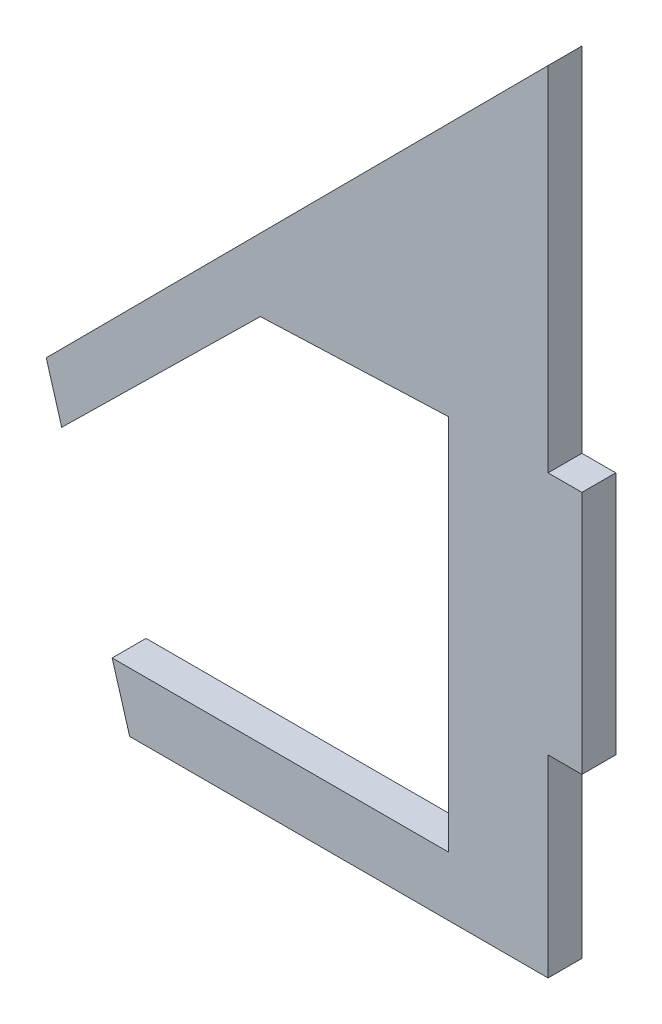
from build123d import *

# Parameters (mm, degrees)
BOSS_EXTRUDE1_DEPTH = 1.524


with BuildPart() as part:
    # Sketch1 → Boss-Extrude1 (new body)
    with BuildSketch(Plane.XY):
        Polygon((-0.895219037, 47.520517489), (-23.482745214, 24.835129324), (-22.785515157, 22.473336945), (-13.845756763, 31.26033865), (-5.376702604, 31.593513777), (-5.376702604, 14.620779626), (-20.514575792, 14.620779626), (-19.727451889, 11.954481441), (-0.895219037, 11.954481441), (-0.895219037, 20.651359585), (0.628780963, 20.651359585), (0.628780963, 31.645019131), (-0.895219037, 31.645019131), align=None)
    extrude(amount=BOSS_EXTRUDE1_DEPTH)


solid = part.part
